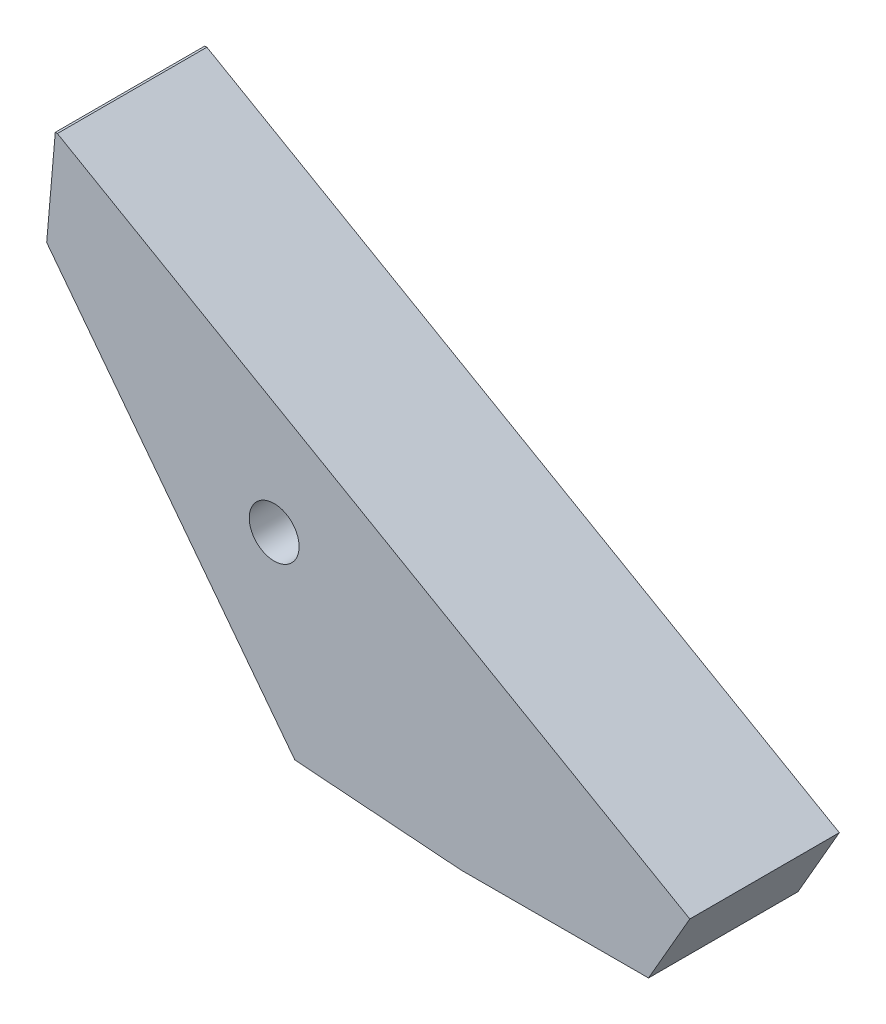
from build123d import *

# Parameters (mm, degrees)
BOSS_EXTRU_1_DEPTH      = 30
BOSS_EXTRU_1_DEPTH_BACK = 30
ESQUISSE1_R             = 10


with BuildPart() as part:
    # Esquisse1 → Boss.-Extru.1 (new, two sides: drawn at the far end of the back side and taken through both)
    with BuildSketch(Plane.XY.offset(-BOSS_EXTRU_1_DEPTH_BACK)):
        Polygon((-87.006032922, 95.074854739), (166.793285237, -51), (150.218878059, -79.797380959), (75, -79.898874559), (8.3, -74.988868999), (-91.291937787, 55.074854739), (-90, 70.074854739), (-87.846770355, 95.074854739), align=None)
        Circle(ESQUISSE1_R, mode=Mode.SUBTRACT)
    extrude(amount=BOSS_EXTRU_1_DEPTH + BOSS_EXTRU_1_DEPTH_BACK)


solid = part.part
